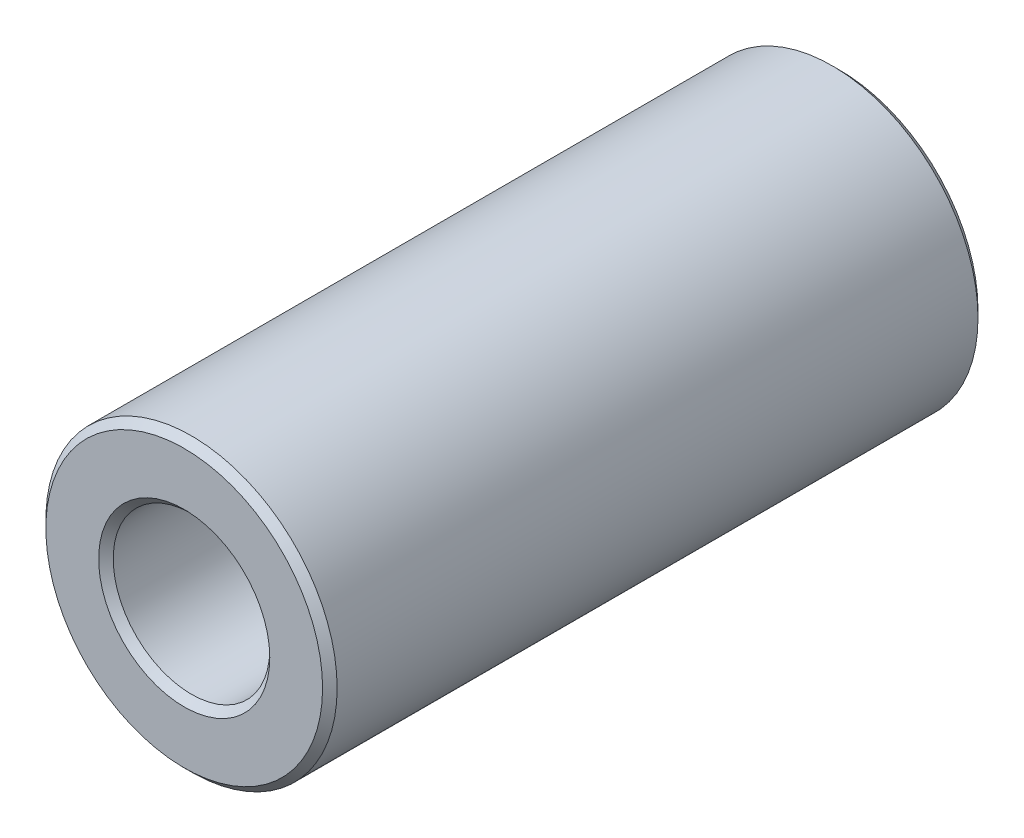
from build123d import *

# Parameters (mm, degrees)
SKETCH1_R           = 4
SKETCH1_R_2         = 2.15
BOSS_EXTRUDE2_DEPTH = 9
CHAMFER3_SIZE       = 0.2


with BuildPart() as part:
    # Sketch1 → Boss-Extrude2 (new, symmetric)
    with BuildSketch(Plane.XY):
        Circle(SKETCH1_R)
        Circle(SKETCH1_R_2, mode=Mode.SUBTRACT)
    extrude(amount=BOSS_EXTRUDE2_DEPTH, both=True)

    # Chamfer3
    chamfer3_edges = [part.edges().sort_by_distance(p)[0] for p in [
        (-4, 0, -9),
        (-4, 0, 9),
        (-2.15, 0, -9),
        (-2.15, 0, 9),
    ]]
    chamfer(chamfer3_edges, length=CHAMFER3_SIZE)


solid = part.part
